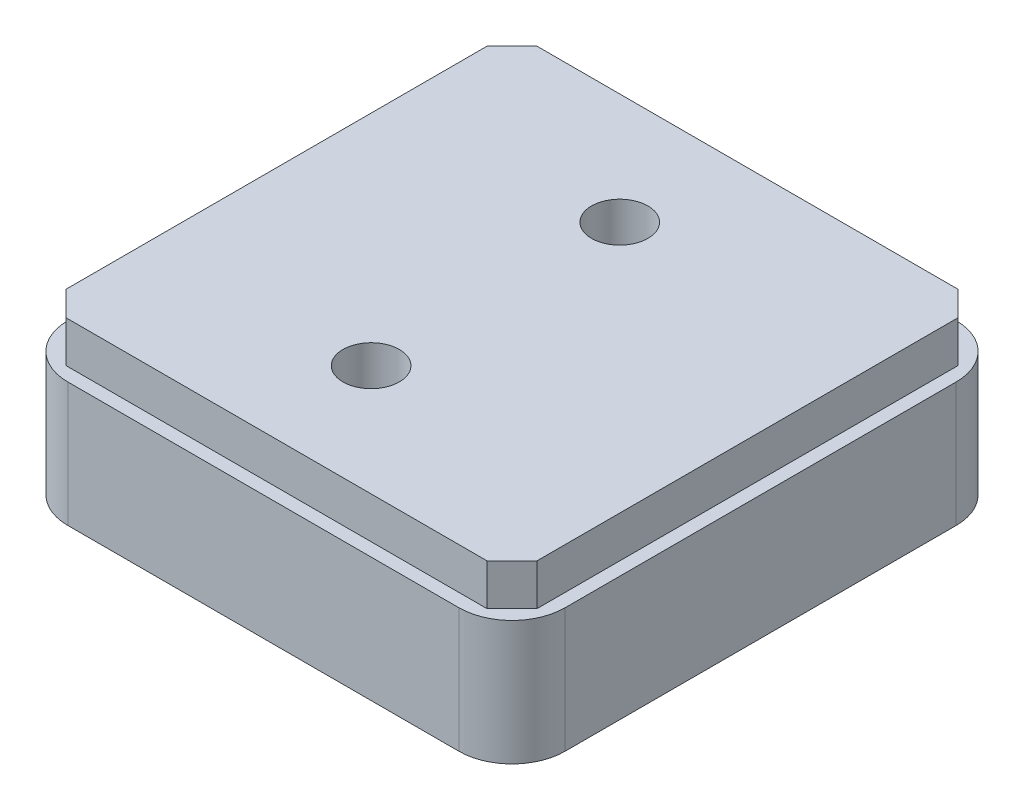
ISO-10303-21;
HEADER;
FILE_DESCRIPTION(('STEP AP214'),'2;1');
FILE_NAME('part.step','',(''),(''),'','','');
FILE_SCHEMA(('AUTOMOTIVE_DESIGN { 1 0 10303 214 1 1 1 1 }'));
ENDSEC;
DATA;
#1=APPLICATION_CONTEXT('core data for automotive mechanical design processes');
#2=APPLICATION_PROTOCOL_DEFINITION('international standard','automotive_design',2000,#1);
#3=PRODUCT_CONTEXT('',#1,'mechanical');
#4=PRODUCT('Part','Part','',(#3));
#5=PRODUCT_RELATED_PRODUCT_CATEGORY('part','',(#4));
#6=PRODUCT_DEFINITION_FORMATION('','',#4);
#7=PRODUCT_DEFINITION_CONTEXT('part definition',#1,'design');
#8=PRODUCT_DEFINITION('design','',#6,#7);
#9=PRODUCT_DEFINITION_SHAPE('','',#8);
#10=(LENGTH_UNIT() NAMED_UNIT(*) SI_UNIT(.MILLI.,.METRE.));
#11=(NAMED_UNIT(*) PLANE_ANGLE_UNIT() SI_UNIT($,.RADIAN.));
#12=(NAMED_UNIT(*) SI_UNIT($,.STERADIAN.) SOLID_ANGLE_UNIT());
#13=UNCERTAINTY_MEASURE_WITH_UNIT(LENGTH_MEASURE(1.E-05),#10,'distance_accuracy_value','');
#14=(GEOMETRIC_REPRESENTATION_CONTEXT(3) GLOBAL_UNCERTAINTY_ASSIGNED_CONTEXT((#13)) GLOBAL_UNIT_ASSIGNED_CONTEXT((#10,
#11,#12)) REPRESENTATION_CONTEXT('',''));
#15=CARTESIAN_POINT('',(0.,0.,0.));
#16=DIRECTION('',(0.,0.,1.));
#17=DIRECTION('',(1.,0.,0.));
#18=AXIS2_PLACEMENT_3D('',#15,#16,#17);
#19=CARTESIAN_POINT('',(-28.4,15.,25.4));
#20=DIRECTION('',(-0.707106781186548,0.,0.707106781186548));
#21=DIRECTION('',(0.707106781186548,0.,0.707106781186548));
#22=AXIS2_PLACEMENT_3D('',#19,#20,#21);
#23=PLANE('',#22);
#24=DIRECTION('',(0.707106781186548,0.,0.707106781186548));
#25=VECTOR('',#24,1.);
#26=CARTESIAN_POINT('',(-28.4,20.,25.4));
#27=LINE('',#26,#25);
#28=CARTESIAN_POINT('',(-28.4,20.,25.4));
#29=VERTEX_POINT('',#28);
#30=CARTESIAN_POINT('',(-25.4,20.,28.4));
#31=VERTEX_POINT('',#30);
#32=EDGE_CURVE('E181',#29,#31,#27,.T.);
#33=ORIENTED_EDGE('',*,*,#32,.F.);
#34=DIRECTION('',(0.,1.,0.));
#35=VECTOR('',#34,1.);
#36=CARTESIAN_POINT('',(-28.4,15.,25.4));
#37=LINE('',#36,#35);
#38=CARTESIAN_POINT('',(-28.4,15.,25.4));
#39=VERTEX_POINT('',#38);
#40=EDGE_CURVE('E13',#39,#29,#37,.T.);
#41=ORIENTED_EDGE('',*,*,#40,.F.);
#42=DIRECTION('',(0.707106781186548,0.,0.707106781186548));
#43=VECTOR('',#42,1.);
#44=CARTESIAN_POINT('',(-28.4,15.,25.4));
#45=LINE('',#44,#43);
#46=CARTESIAN_POINT('',(-25.4,15.,28.4));
#47=VERTEX_POINT('',#46);
#48=EDGE_CURVE('E202',#39,#47,#45,.T.);
#49=ORIENTED_EDGE('',*,*,#48,.T.);
#50=DIRECTION('',(0.,1.,0.));
#51=VECTOR('',#50,1.);
#52=CARTESIAN_POINT('',(-25.4,15.,28.4));
#53=LINE('',#52,#51);
#54=EDGE_CURVE('E87',#47,#31,#53,.T.);
#55=ORIENTED_EDGE('',*,*,#54,.T.);
#56=EDGE_LOOP('',(#33,#41,#49,#55));
#57=FACE_BOUND('',#56,.T.);
#58=ADVANCED_FACE('F84',(#57),#23,.T.);
#59=CARTESIAN_POINT('',(-28.4,15.,-25.4));
#60=DIRECTION('',(-1.,0.,0.));
#61=DIRECTION('',(0.,0.,1.));
#62=AXIS2_PLACEMENT_3D('',#59,#60,#61);
#63=PLANE('',#62);
#64=DIRECTION('',(0.,0.,1.));
#65=VECTOR('',#64,1.);
#66=CARTESIAN_POINT('',(-28.4,20.,-25.4));
#67=LINE('',#66,#65);
#68=CARTESIAN_POINT('',(-28.4,20.,-25.4));
#69=VERTEX_POINT('',#68);
#70=EDGE_CURVE('E200',#69,#29,#67,.T.);
#71=ORIENTED_EDGE('',*,*,#70,.F.);
#72=DIRECTION('',(0.,1.,0.));
#73=VECTOR('',#72,1.);
#74=CARTESIAN_POINT('',(-28.4,15.,-25.4));
#75=LINE('',#74,#73);
#76=CARTESIAN_POINT('',(-28.4,15.,-25.4));
#77=VERTEX_POINT('',#76);
#78=EDGE_CURVE('E93',#77,#69,#75,.T.);
#79=ORIENTED_EDGE('',*,*,#78,.F.);
#80=DIRECTION('',(0.,0.,1.));
#81=VECTOR('',#80,1.);
#82=CARTESIAN_POINT('',(-28.4,15.,-25.4));
#83=LINE('',#82,#81);
#84=EDGE_CURVE('E171',#77,#39,#83,.T.);
#85=ORIENTED_EDGE('',*,*,#84,.T.);
#86=ORIENTED_EDGE('',*,*,#40,.T.);
#87=EDGE_LOOP('',(#71,#79,#85,#86));
#88=FACE_BOUND('',#87,.T.);
#89=ADVANCED_FACE('F214',(#88),#63,.T.);
#90=CARTESIAN_POINT('',(-25.4,15.,-28.4));
#91=DIRECTION('',(-0.707106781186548,0.,-0.707106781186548));
#92=DIRECTION('',(-0.707106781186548,0.,0.707106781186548));
#93=AXIS2_PLACEMENT_3D('',#90,#91,#92);
#94=PLANE('',#93);
#95=DIRECTION('',(-0.707106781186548,0.,0.707106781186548));
#96=VECTOR('',#95,1.);
#97=CARTESIAN_POINT('',(-25.4,20.,-28.4));
#98=LINE('',#97,#96);
#99=CARTESIAN_POINT('',(-25.4,20.,-28.4));
#100=VERTEX_POINT('',#99);
#101=EDGE_CURVE('E158',#100,#69,#98,.T.);
#102=ORIENTED_EDGE('',*,*,#101,.F.);
#103=DIRECTION('',(0.,1.,0.));
#104=VECTOR('',#103,1.);
#105=CARTESIAN_POINT('',(-25.4,15.,-28.4));
#106=LINE('',#105,#104);
#107=CARTESIAN_POINT('',(-25.4,15.,-28.4));
#108=VERTEX_POINT('',#107);
#109=EDGE_CURVE('E153',#108,#100,#106,.T.);
#110=ORIENTED_EDGE('',*,*,#109,.F.);
#111=DIRECTION('',(-0.707106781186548,0.,0.707106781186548));
#112=VECTOR('',#111,1.);
#113=CARTESIAN_POINT('',(-25.4,15.,-28.4));
#114=LINE('',#113,#112);
#115=EDGE_CURVE('E156',#108,#77,#114,.T.);
#116=ORIENTED_EDGE('',*,*,#115,.T.);
#117=ORIENTED_EDGE('',*,*,#78,.T.);
#118=EDGE_LOOP('',(#102,#110,#116,#117));
#119=FACE_BOUND('',#118,.T.);
#120=ADVANCED_FACE('F155',(#119),#94,.T.);
#121=CARTESIAN_POINT('',(25.4,15.,-28.4));
#122=DIRECTION('',(0.,0.,-1.));
#123=DIRECTION('',(-1.,0.,0.));
#124=AXIS2_PLACEMENT_3D('',#121,#122,#123);
#125=PLANE('',#124);
#126=DIRECTION('',(-1.,0.,0.));
#127=VECTOR('',#126,1.);
#128=CARTESIAN_POINT('',(25.4,20.,-28.4));
#129=LINE('',#128,#127);
#130=CARTESIAN_POINT('',(25.4,20.,-28.4));
#131=VERTEX_POINT('',#130);
#132=EDGE_CURVE('E197',#131,#100,#129,.T.);
#133=ORIENTED_EDGE('',*,*,#132,.F.);
#134=DIRECTION('',(0.,1.,0.));
#135=VECTOR('',#134,1.);
#136=CARTESIAN_POINT('',(25.4,15.,-28.4));
#137=LINE('',#136,#135);
#138=CARTESIAN_POINT('',(25.4,15.,-28.4));
#139=VERTEX_POINT('',#138);
#140=EDGE_CURVE('E163',#139,#131,#137,.T.);
#141=ORIENTED_EDGE('',*,*,#140,.F.);
#142=DIRECTION('',(-1.,0.,0.));
#143=VECTOR('',#142,1.);
#144=CARTESIAN_POINT('',(25.4,15.,-28.4));
#145=LINE('',#144,#143);
#146=EDGE_CURVE('E169',#139,#108,#145,.T.);
#147=ORIENTED_EDGE('',*,*,#146,.T.);
#148=ORIENTED_EDGE('',*,*,#109,.T.);
#149=EDGE_LOOP('',(#133,#141,#147,#148));
#150=FACE_BOUND('',#149,.T.);
#151=ADVANCED_FACE('F173',(#150),#125,.T.);
#152=CARTESIAN_POINT('',(28.4,15.,-25.4));
#153=DIRECTION('',(0.707106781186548,0.,-0.707106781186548));
#154=DIRECTION('',(-0.707106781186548,0.,-0.707106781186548));
#155=AXIS2_PLACEMENT_3D('',#152,#153,#154);
#156=PLANE('',#155);
#157=DIRECTION('',(-0.707106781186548,0.,-0.707106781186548));
#158=VECTOR('',#157,1.);
#159=CARTESIAN_POINT('',(28.4,20.,-25.4));
#160=LINE('',#159,#158);
#161=CARTESIAN_POINT('',(28.4,20.,-25.4));
#162=VERTEX_POINT('',#161);
#163=EDGE_CURVE('E194',#162,#131,#160,.T.);
#164=ORIENTED_EDGE('',*,*,#163,.F.);
#165=DIRECTION('',(0.,1.,0.));
#166=VECTOR('',#165,1.);
#167=CARTESIAN_POINT('',(28.4,15.,-25.4));
#168=LINE('',#167,#166);
#169=CARTESIAN_POINT('',(28.4,15.,-25.4));
#170=VERTEX_POINT('',#169);
#171=EDGE_CURVE('E206',#170,#162,#168,.T.);
#172=ORIENTED_EDGE('',*,*,#171,.F.);
#173=DIRECTION('',(-0.707106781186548,0.,-0.707106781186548));
#174=VECTOR('',#173,1.);
#175=CARTESIAN_POINT('',(28.4,15.,-25.4));
#176=LINE('',#175,#174);
#177=EDGE_CURVE('E174',#170,#139,#176,.T.);
#178=ORIENTED_EDGE('',*,*,#177,.T.);
#179=ORIENTED_EDGE('',*,*,#140,.T.);
#180=EDGE_LOOP('',(#164,#172,#178,#179));
#181=FACE_BOUND('',#180,.T.);
#182=ADVANCED_FACE('F227',(#181),#156,.T.);
#183=CARTESIAN_POINT('',(28.4,15.,25.4));
#184=DIRECTION('',(1.,0.,0.));
#185=DIRECTION('',(0.,0.,-1.));
#186=AXIS2_PLACEMENT_3D('',#183,#184,#185);
#187=PLANE('',#186);
#188=DIRECTION('',(0.,0.,-1.));
#189=VECTOR('',#188,1.);
#190=CARTESIAN_POINT('',(28.4,20.,25.4));
#191=LINE('',#190,#189);
#192=CARTESIAN_POINT('',(28.4,20.,25.4));
#193=VERTEX_POINT('',#192);
#194=EDGE_CURVE('E191',#193,#162,#191,.T.);
#195=ORIENTED_EDGE('',*,*,#194,.F.);
#196=DIRECTION('',(0.,1.,0.));
#197=VECTOR('',#196,1.);
#198=CARTESIAN_POINT('',(28.4,15.,25.4));
#199=LINE('',#198,#197);
#200=CARTESIAN_POINT('',(28.4,15.,25.4));
#201=VERTEX_POINT('',#200);
#202=EDGE_CURVE('E208',#201,#193,#199,.T.);
#203=ORIENTED_EDGE('',*,*,#202,.F.);
#204=DIRECTION('',(0.,0.,-1.));
#205=VECTOR('',#204,1.);
#206=CARTESIAN_POINT('',(28.4,15.,25.4));
#207=LINE('',#206,#205);
#208=EDGE_CURVE('E176',#201,#170,#207,.T.);
#209=ORIENTED_EDGE('',*,*,#208,.T.);
#210=ORIENTED_EDGE('',*,*,#171,.T.);
#211=EDGE_LOOP('',(#195,#203,#209,#210));
#212=FACE_BOUND('',#211,.T.);
#213=ADVANCED_FACE('F230',(#212),#187,.T.);
#214=CARTESIAN_POINT('',(25.4,15.,28.4));
#215=DIRECTION('',(0.707106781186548,0.,0.707106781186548));
#216=DIRECTION('',(0.707106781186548,0.,-0.707106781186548));
#217=AXIS2_PLACEMENT_3D('',#214,#215,#216);
#218=PLANE('',#217);
#219=DIRECTION('',(0.707106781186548,0.,-0.707106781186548));
#220=VECTOR('',#219,1.);
#221=CARTESIAN_POINT('',(25.4,20.,28.4));
#222=LINE('',#221,#220);
#223=CARTESIAN_POINT('',(25.4,20.,28.4));
#224=VERTEX_POINT('',#223);
#225=EDGE_CURVE('E188',#224,#193,#222,.T.);
#226=ORIENTED_EDGE('',*,*,#225,.F.);
#227=DIRECTION('',(0.,1.,0.));
#228=VECTOR('',#227,1.);
#229=CARTESIAN_POINT('',(25.4,15.,28.4));
#230=LINE('',#229,#228);
#231=CARTESIAN_POINT('',(25.4,15.,28.4));
#232=VERTEX_POINT('',#231);
#233=EDGE_CURVE('E209',#232,#224,#230,.T.);
#234=ORIENTED_EDGE('',*,*,#233,.F.);
#235=DIRECTION('',(0.707106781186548,0.,-0.707106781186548));
#236=VECTOR('',#235,1.);
#237=CARTESIAN_POINT('',(25.4,15.,28.4));
#238=LINE('',#237,#236);
#239=EDGE_CURVE('E276',#232,#201,#238,.T.);
#240=ORIENTED_EDGE('',*,*,#239,.T.);
#241=ORIENTED_EDGE('',*,*,#202,.T.);
#242=EDGE_LOOP('',(#226,#234,#240,#241));
#243=FACE_BOUND('',#242,.T.);
#244=ADVANCED_FACE('F234',(#243),#218,.T.);
#245=CARTESIAN_POINT('',(-25.4,15.,28.4));
#246=DIRECTION('',(0.,0.,1.));
#247=DIRECTION('',(1.,0.,0.));
#248=AXIS2_PLACEMENT_3D('',#245,#246,#247);
#249=PLANE('',#248);
#250=DIRECTION('',(1.,0.,0.));
#251=VECTOR('',#250,1.);
#252=CARTESIAN_POINT('',(-25.4,20.,28.4));
#253=LINE('',#252,#251);
#254=EDGE_CURVE('E184',#31,#224,#253,.T.);
#255=ORIENTED_EDGE('',*,*,#254,.F.);
#256=ORIENTED_EDGE('',*,*,#54,.F.);
#257=DIRECTION('',(1.,0.,0.));
#258=VECTOR('',#257,1.);
#259=CARTESIAN_POINT('',(-25.4,15.,28.4));
#260=LINE('',#259,#258);
#261=EDGE_CURVE('E274',#47,#232,#260,.T.);
#262=ORIENTED_EDGE('',*,*,#261,.T.);
#263=ORIENTED_EDGE('',*,*,#233,.T.);
#264=EDGE_LOOP('',(#255,#256,#262,#263));
#265=FACE_BOUND('',#264,.T.);
#266=ADVANCED_FACE('F211',(#265),#249,.T.);
#267=CARTESIAN_POINT('',(0.,15.,53.8));
#268=DIRECTION('',(0.,1.,0.));
#269=DIRECTION('',(0.,0.,1.));
#270=AXIS2_PLACEMENT_3D('',#267,#268,#269);
#271=PLANE('',#270);
#272=CARTESIAN_POINT('',(-2.,15.,-15.));
#273=DIRECTION('',(0.,1.,0.));
#274=DIRECTION('',(0.,0.,1.));
#275=AXIS2_PLACEMENT_3D('',#272,#273,#274);
#276=CIRCLE('',#275,3.39999999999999);
#277=CARTESIAN_POINT('',(-2.,15.,-11.6));
#278=VERTEX_POINT('',#277);
#279=EDGE_CURVE('E261',#278,#278,#276,.T.);
#280=ORIENTED_EDGE('',*,*,#279,.T.);
#281=EDGE_LOOP('',(#280));
#282=FACE_BOUND('',#281,.T.);
#283=CARTESIAN_POINT('',(-2.,15.,15.));
#284=DIRECTION('',(0.,1.,0.));
#285=DIRECTION('',(0.,0.,1.));
#286=AXIS2_PLACEMENT_3D('',#283,#284,#285);
#287=CIRCLE('',#286,3.39999999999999);
#288=CARTESIAN_POINT('',(-2.,15.,18.4));
#289=VERTEX_POINT('',#288);
#290=EDGE_CURVE('E185',#289,#289,#287,.T.);
#291=ORIENTED_EDGE('',*,*,#290,.T.);
#292=EDGE_LOOP('',(#291));
#293=FACE_BOUND('',#292,.T.);
#294=ORIENTED_EDGE('',*,*,#48,.F.);
#295=ORIENTED_EDGE('',*,*,#84,.F.);
#296=ORIENTED_EDGE('',*,*,#115,.F.);
#297=ORIENTED_EDGE('',*,*,#146,.F.);
#298=ORIENTED_EDGE('',*,*,#177,.F.);
#299=ORIENTED_EDGE('',*,*,#208,.F.);
#300=ORIENTED_EDGE('',*,*,#239,.F.);
#301=ORIENTED_EDGE('',*,*,#261,.F.);
#302=EDGE_LOOP('',(#294,#295,#296,#297,#298,#299,#300,#301));
#303=FACE_BOUND('',#302,.T.);
#304=ADVANCED_FACE('F167',(#282,#293,#303),#271,.F.);
#305=CARTESIAN_POINT('',(0.,20.,53.8));
#306=DIRECTION('',(0.,1.,0.));
#307=DIRECTION('',(0.,0.,1.));
#308=AXIS2_PLACEMENT_3D('',#305,#306,#307);
#309=PLANE('',#308);
#310=CARTESIAN_POINT('',(-2.,20.,-15.));
#311=DIRECTION('',(0.,1.,0.));
#312=DIRECTION('',(0.,0.,1.));
#313=AXIS2_PLACEMENT_3D('',#310,#311,#312);
#314=CIRCLE('',#313,3.39999999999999);
#315=CARTESIAN_POINT('',(-2.,20.,-11.6));
#316=VERTEX_POINT('',#315);
#317=EDGE_CURVE('E264',#316,#316,#314,.T.);
#318=ORIENTED_EDGE('',*,*,#317,.F.);
#319=EDGE_LOOP('',(#318));
#320=FACE_BOUND('',#319,.T.);
#321=CARTESIAN_POINT('',(-2.,20.,15.));
#322=DIRECTION('',(0.,1.,0.));
#323=DIRECTION('',(0.,0.,1.));
#324=AXIS2_PLACEMENT_3D('',#321,#322,#323);
#325=CIRCLE('',#324,3.39999999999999);
#326=CARTESIAN_POINT('',(-2.,20.,18.4));
#327=VERTEX_POINT('',#326);
#328=EDGE_CURVE('E266',#327,#327,#325,.T.);
#329=ORIENTED_EDGE('',*,*,#328,.F.);
#330=EDGE_LOOP('',(#329));
#331=FACE_BOUND('',#330,.T.);
#332=ORIENTED_EDGE('',*,*,#32,.T.);
#333=ORIENTED_EDGE('',*,*,#254,.T.);
#334=ORIENTED_EDGE('',*,*,#225,.T.);
#335=ORIENTED_EDGE('',*,*,#194,.T.);
#336=ORIENTED_EDGE('',*,*,#163,.T.);
#337=ORIENTED_EDGE('',*,*,#132,.T.);
#338=ORIENTED_EDGE('',*,*,#101,.T.);
#339=ORIENTED_EDGE('',*,*,#70,.T.);
#340=EDGE_LOOP('',(#332,#333,#334,#335,#336,#337,#338,#339));
#341=FACE_BOUND('',#340,.T.);
#342=ADVANCED_FACE('F213',(#320,#331,#341),#309,.T.);
#343=CARTESIAN_POINT('',(-2.,20.,15.));
#344=DIRECTION('',(0.,1.,0.));
#345=DIRECTION('',(0.,0.,1.));
#346=AXIS2_PLACEMENT_3D('',#343,#344,#345);
#347=CYLINDRICAL_SURFACE('',#346,3.39999999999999);
#348=ORIENTED_EDGE('',*,*,#290,.F.);
#349=EDGE_LOOP('',(#348));
#350=FACE_BOUND('',#349,.T.);
#351=ORIENTED_EDGE('',*,*,#328,.T.);
#352=EDGE_LOOP('',(#351));
#353=FACE_BOUND('',#352,.T.);
#354=ADVANCED_FACE('F246',(#350,#353),#347,.F.);
#355=CARTESIAN_POINT('',(-2.,20.,-15.));
#356=DIRECTION('',(0.,1.,0.));
#357=DIRECTION('',(0.,0.,1.));
#358=AXIS2_PLACEMENT_3D('',#355,#356,#357);
#359=CYLINDRICAL_SURFACE('',#358,3.39999999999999);
#360=ORIENTED_EDGE('',*,*,#279,.F.);
#361=EDGE_LOOP('',(#360));
#362=FACE_BOUND('',#361,.T.);
#363=ORIENTED_EDGE('',*,*,#317,.T.);
#364=EDGE_LOOP('',(#363));
#365=FACE_BOUND('',#364,.T.);
#366=ADVANCED_FACE('F253',(#362,#365),#359,.F.);
#367=CLOSED_SHELL('',(#58,#89,#120,#151,#182,#213,#244,#266,#304,#342,#354,#366));
#368=MANIFOLD_SOLID_BREP('B2',#367);
#369=CARTESIAN_POINT('',(-23.6,20.,23.6));
#370=DIRECTION('',(0.,-1.,0.));
#371=DIRECTION('',(0.,0.,-1.));
#372=AXIS2_PLACEMENT_3D('',#369,#370,#371);
#373=CYLINDRICAL_SURFACE('',#372,6.4);
#374=CARTESIAN_POINT('',(-23.6,0.,23.6));
#375=DIRECTION('',(0.,1.,0.));
#376=DIRECTION('',(0.,0.,1.));
#377=AXIS2_PLACEMENT_3D('',#374,#375,#376);
#378=CIRCLE('',#377,6.4);
#379=CARTESIAN_POINT('',(-30.,0.,23.6));
#380=VERTEX_POINT('',#379);
#381=CARTESIAN_POINT('',(-23.6,0.,30.));
#382=VERTEX_POINT('',#381);
#383=EDGE_CURVE('E526',#380,#382,#378,.T.);
#384=ORIENTED_EDGE('',*,*,#383,.T.);
#385=DIRECTION('',(0.,-1.,0.));
#386=VECTOR('',#385,1.);
#387=CARTESIAN_POINT('',(-23.6,20.,30.));
#388=LINE('',#387,#386);
#389=CARTESIAN_POINT('',(-23.6,15.,30.));
#390=VERTEX_POINT('',#389);
#391=EDGE_CURVE('E82',#390,#382,#388,.T.);
#392=ORIENTED_EDGE('',*,*,#391,.F.);
#393=CARTESIAN_POINT('',(-23.6,15.,23.6));
#394=DIRECTION('',(0.,1.,0.));
#395=DIRECTION('',(0.,0.,1.));
#396=AXIS2_PLACEMENT_3D('',#393,#394,#395);
#397=CIRCLE('',#396,6.4);
#398=CARTESIAN_POINT('',(-30.,15.,23.6));
#399=VERTEX_POINT('',#398);
#400=EDGE_CURVE('E573',#399,#390,#397,.T.);
#401=ORIENTED_EDGE('',*,*,#400,.F.);
#402=DIRECTION('',(0.,-1.,0.));
#403=VECTOR('',#402,1.);
#404=CARTESIAN_POINT('',(-30.,20.,23.6));
#405=LINE('',#404,#403);
#406=EDGE_CURVE('E497',#399,#380,#405,.T.);
#407=ORIENTED_EDGE('',*,*,#406,.T.);
#408=EDGE_LOOP('',(#384,#392,#401,#407));
#409=FACE_BOUND('',#408,.T.);
#410=ADVANCED_FACE('F357',(#409),#373,.T.);
#411=CARTESIAN_POINT('',(-23.6,20.,30.));
#412=DIRECTION('',(0.,0.,-1.));
#413=DIRECTION('',(-1.,0.,0.));
#414=AXIS2_PLACEMENT_3D('',#411,#412,#413);
#415=PLANE('',#414);
#416=DIRECTION('',(1.,0.,0.));
#417=VECTOR('',#416,1.);
#418=CARTESIAN_POINT('',(-23.6,0.,30.));
#419=LINE('',#418,#417);
#420=CARTESIAN_POINT('',(23.6,0.,30.));
#421=VERTEX_POINT('',#420);
#422=EDGE_CURVE('E529',#382,#421,#419,.T.);
#423=ORIENTED_EDGE('',*,*,#422,.T.);
#424=DIRECTION('',(0.,-1.,0.));
#425=VECTOR('',#424,1.);
#426=CARTESIAN_POINT('',(23.6,20.,30.));
#427=LINE('',#426,#425);
#428=CARTESIAN_POINT('',(23.6,15.,30.));
#429=VERTEX_POINT('',#428);
#430=EDGE_CURVE('E367',#429,#421,#427,.T.);
#431=ORIENTED_EDGE('',*,*,#430,.F.);
#432=DIRECTION('',(1.,0.,0.));
#433=VECTOR('',#432,1.);
#434=CARTESIAN_POINT('',(-23.6,15.,30.));
#435=LINE('',#434,#433);
#436=EDGE_CURVE('E361',#390,#429,#435,.T.);
#437=ORIENTED_EDGE('',*,*,#436,.F.);
#438=ORIENTED_EDGE('',*,*,#391,.T.);
#439=EDGE_LOOP('',(#423,#431,#437,#438));
#440=FACE_BOUND('',#439,.T.);
#441=ADVANCED_FACE('F627',(#440),#415,.F.);
#442=CARTESIAN_POINT('',(23.6,20.,23.6));
#443=DIRECTION('',(0.,-1.,0.));
#444=DIRECTION('',(0.,0.,-1.));
#445=AXIS2_PLACEMENT_3D('',#442,#443,#444);
#446=CYLINDRICAL_SURFACE('',#445,6.4);
#447=CARTESIAN_POINT('',(23.6,0.,23.6));
#448=DIRECTION('',(0.,1.,0.));
#449=DIRECTION('',(0.,0.,1.));
#450=AXIS2_PLACEMENT_3D('',#447,#448,#449);
#451=CIRCLE('',#450,6.4);
#452=CARTESIAN_POINT('',(30.,0.,23.6));
#453=VERTEX_POINT('',#452);
#454=EDGE_CURVE('E531',#421,#453,#451,.T.);
#455=ORIENTED_EDGE('',*,*,#454,.T.);
#456=DIRECTION('',(0.,-1.,0.));
#457=VECTOR('',#456,1.);
#458=CARTESIAN_POINT('',(30.,20.,23.6));
#459=LINE('',#458,#457);
#460=CARTESIAN_POINT('',(30.,15.,23.6));
#461=VERTEX_POINT('',#460);
#462=EDGE_CURVE('E553',#461,#453,#459,.T.);
#463=ORIENTED_EDGE('',*,*,#462,.F.);
#464=CARTESIAN_POINT('',(23.6,15.,23.6));
#465=DIRECTION('',(0.,1.,0.));
#466=DIRECTION('',(0.,0.,1.));
#467=AXIS2_PLACEMENT_3D('',#464,#465,#466);
#468=CIRCLE('',#467,6.4);
#469=EDGE_CURVE('E599',#429,#461,#468,.T.);
#470=ORIENTED_EDGE('',*,*,#469,.F.);
#471=ORIENTED_EDGE('',*,*,#430,.T.);
#472=EDGE_LOOP('',(#455,#463,#470,#471));
#473=FACE_BOUND('',#472,.T.);
#474=ADVANCED_FACE('F605',(#473),#446,.T.);
#475=CARTESIAN_POINT('',(30.,20.,-23.6));
#476=DIRECTION('',(-1.,0.,0.));
#477=DIRECTION('',(0.,0.,1.));
#478=AXIS2_PLACEMENT_3D('',#475,#476,#477);
#479=PLANE('',#478);
#480=DIRECTION('',(0.,0.,-1.));
#481=VECTOR('',#480,1.);
#482=CARTESIAN_POINT('',(30.,0.,-23.6));
#483=LINE('',#482,#481);
#484=CARTESIAN_POINT('',(30.,0.,-23.6));
#485=VERTEX_POINT('',#484);
#486=EDGE_CURVE('E533',#453,#485,#483,.T.);
#487=ORIENTED_EDGE('',*,*,#486,.T.);
#488=DIRECTION('',(0.,-1.,0.));
#489=VECTOR('',#488,1.);
#490=CARTESIAN_POINT('',(30.,20.,-23.6));
#491=LINE('',#490,#489);
#492=CARTESIAN_POINT('',(30.,15.,-23.6));
#493=VERTEX_POINT('',#492);
#494=EDGE_CURVE('E550',#493,#485,#491,.T.);
#495=ORIENTED_EDGE('',*,*,#494,.F.);
#496=DIRECTION('',(0.,0.,-1.));
#497=VECTOR('',#496,1.);
#498=CARTESIAN_POINT('',(30.,15.,-23.6));
#499=LINE('',#498,#497);
#500=EDGE_CURVE('E598',#461,#493,#499,.T.);
#501=ORIENTED_EDGE('',*,*,#500,.F.);
#502=ORIENTED_EDGE('',*,*,#462,.T.);
#503=EDGE_LOOP('',(#487,#495,#501,#502));
#504=FACE_BOUND('',#503,.T.);
#505=ADVANCED_FACE('F609',(#504),#479,.F.);
#506=CARTESIAN_POINT('',(23.6,20.,-23.6));
#507=DIRECTION('',(0.,-1.,0.));
#508=DIRECTION('',(0.,0.,-1.));
#509=AXIS2_PLACEMENT_3D('',#506,#507,#508);
#510=CYLINDRICAL_SURFACE('',#509,6.4);
#511=CARTESIAN_POINT('',(23.6,0.,-23.6));
#512=DIRECTION('',(0.,1.,0.));
#513=DIRECTION('',(0.,0.,1.));
#514=AXIS2_PLACEMENT_3D('',#511,#512,#513);
#515=CIRCLE('',#514,6.4);
#516=CARTESIAN_POINT('',(23.6,0.,-30.));
#517=VERTEX_POINT('',#516);
#518=EDGE_CURVE('E535',#485,#517,#515,.T.);
#519=ORIENTED_EDGE('',*,*,#518,.T.);
#520=DIRECTION('',(0.,-1.,0.));
#521=VECTOR('',#520,1.);
#522=CARTESIAN_POINT('',(23.6,20.,-30.));
#523=LINE('',#522,#521);
#524=CARTESIAN_POINT('',(23.6,15.,-30.));
#525=VERTEX_POINT('',#524);
#526=EDGE_CURVE('E547',#525,#517,#523,.T.);
#527=ORIENTED_EDGE('',*,*,#526,.F.);
#528=CARTESIAN_POINT('',(23.6,15.,-23.6));
#529=DIRECTION('',(0.,1.,0.));
#530=DIRECTION('',(0.,0.,1.));
#531=AXIS2_PLACEMENT_3D('',#528,#529,#530);
#532=CIRCLE('',#531,6.4);
#533=EDGE_CURVE('E596',#493,#525,#532,.T.);
#534=ORIENTED_EDGE('',*,*,#533,.F.);
#535=ORIENTED_EDGE('',*,*,#494,.T.);
#536=EDGE_LOOP('',(#519,#527,#534,#535));
#537=FACE_BOUND('',#536,.T.);
#538=ADVANCED_FACE('F614',(#537),#510,.T.);
#539=CARTESIAN_POINT('',(23.6,20.,-30.));
#540=DIRECTION('',(0.,0.,1.));
#541=DIRECTION('',(1.,0.,0.));
#542=AXIS2_PLACEMENT_3D('',#539,#540,#541);
#543=PLANE('',#542);
#544=DIRECTION('',(-1.,0.,0.));
#545=VECTOR('',#544,1.);
#546=CARTESIAN_POINT('',(23.6,0.,-30.));
#547=LINE('',#546,#545);
#548=CARTESIAN_POINT('',(-23.6,0.,-30.));
#549=VERTEX_POINT('',#548);
#550=EDGE_CURVE('E537',#517,#549,#547,.T.);
#551=ORIENTED_EDGE('',*,*,#550,.T.);
#552=DIRECTION('',(0.,-1.,0.));
#553=VECTOR('',#552,1.);
#554=CARTESIAN_POINT('',(-23.6,20.,-30.));
#555=LINE('',#554,#553);
#556=CARTESIAN_POINT('',(-23.6,15.,-30.));
#557=VERTEX_POINT('',#556);
#558=EDGE_CURVE('E545',#557,#549,#555,.T.);
#559=ORIENTED_EDGE('',*,*,#558,.F.);
#560=DIRECTION('',(-1.,0.,0.));
#561=VECTOR('',#560,1.);
#562=CARTESIAN_POINT('',(23.6,15.,-30.));
#563=LINE('',#562,#561);
#564=EDGE_CURVE('E594',#525,#557,#563,.T.);
#565=ORIENTED_EDGE('',*,*,#564,.F.);
#566=ORIENTED_EDGE('',*,*,#526,.T.);
#567=EDGE_LOOP('',(#551,#559,#565,#566));
#568=FACE_BOUND('',#567,.T.);
#569=ADVANCED_FACE('F619',(#568),#543,.F.);
#570=CARTESIAN_POINT('',(-23.6,20.,-23.6));
#571=DIRECTION('',(0.,-1.,0.));
#572=DIRECTION('',(0.,0.,-1.));
#573=AXIS2_PLACEMENT_3D('',#570,#571,#572);
#574=CYLINDRICAL_SURFACE('',#573,6.4);
#575=CARTESIAN_POINT('',(-23.6,0.,-23.6));
#576=DIRECTION('',(0.,1.,0.));
#577=DIRECTION('',(0.,0.,1.));
#578=AXIS2_PLACEMENT_3D('',#575,#576,#577);
#579=CIRCLE('',#578,6.4);
#580=CARTESIAN_POINT('',(-30.,0.,-23.6));
#581=VERTEX_POINT('',#580);
#582=EDGE_CURVE('E453',#549,#581,#579,.T.);
#583=ORIENTED_EDGE('',*,*,#582,.T.);
#584=DIRECTION('',(0.,-1.,0.));
#585=VECTOR('',#584,1.);
#586=CARTESIAN_POINT('',(-30.,20.,-23.6));
#587=LINE('',#586,#585);
#588=CARTESIAN_POINT('',(-30.,15.,-23.6));
#589=VERTEX_POINT('',#588);
#590=EDGE_CURVE('E543',#589,#581,#587,.T.);
#591=ORIENTED_EDGE('',*,*,#590,.F.);
#592=CARTESIAN_POINT('',(-23.6,15.,-23.6));
#593=DIRECTION('',(0.,1.,0.));
#594=DIRECTION('',(0.,0.,1.));
#595=AXIS2_PLACEMENT_3D('',#592,#593,#594);
#596=CIRCLE('',#595,6.4);
#597=EDGE_CURVE('E592',#557,#589,#596,.T.);
#598=ORIENTED_EDGE('',*,*,#597,.F.);
#599=ORIENTED_EDGE('',*,*,#558,.T.);
#600=EDGE_LOOP('',(#583,#591,#598,#599));
#601=FACE_BOUND('',#600,.T.);
#602=ADVANCED_FACE('F621',(#601),#574,.T.);
#603=CARTESIAN_POINT('',(23.6,20.,23.6));
#604=DIRECTION('',(0.,-1.,0.));
#605=DIRECTION('',(0.,0.,-1.));
#606=AXIS2_PLACEMENT_3D('',#603,#604,#605);
#607=CYLINDRICAL_SURFACE('',#606,3.20000000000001);
#608=CARTESIAN_POINT('',(23.6,0.,23.6));
#609=DIRECTION('',(0.,1.,0.));
#610=DIRECTION('',(0.,0.,1.));
#611=AXIS2_PLACEMENT_3D('',#608,#609,#610);
#612=CIRCLE('',#611,3.20000000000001);
#613=CARTESIAN_POINT('',(23.6,0.,26.8));
#614=VERTEX_POINT('',#613);
#615=CARTESIAN_POINT('',(26.8,0.,23.6));
#616=VERTEX_POINT('',#615);
#617=EDGE_CURVE('E500',#614,#616,#612,.T.);
#618=ORIENTED_EDGE('',*,*,#617,.F.);
#619=DIRECTION('',(0.,-1.,0.));
#620=VECTOR('',#619,1.);
#621=CARTESIAN_POINT('',(23.6,20.,26.8));
#622=LINE('',#621,#620);
#623=CARTESIAN_POINT('',(23.6,15.,26.8));
#624=VERTEX_POINT('',#623);
#625=EDGE_CURVE('E438',#624,#614,#622,.T.);
#626=ORIENTED_EDGE('',*,*,#625,.F.);
#627=CARTESIAN_POINT('',(23.6,15.,23.6));
#628=DIRECTION('',(0.,1.,0.));
#629=DIRECTION('',(0.,0.,1.));
#630=AXIS2_PLACEMENT_3D('',#627,#628,#629);
#631=CIRCLE('',#630,3.20000000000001);
#632=CARTESIAN_POINT('',(26.8,15.,23.6));
#633=VERTEX_POINT('',#632);
#634=EDGE_CURVE('E541',#624,#633,#631,.T.);
#635=ORIENTED_EDGE('',*,*,#634,.T.);
#636=DIRECTION('',(0.,-1.,0.));
#637=VECTOR('',#636,1.);
#638=CARTESIAN_POINT('',(26.8,20.,23.6));
#639=LINE('',#638,#637);
#640=EDGE_CURVE('E407',#633,#616,#639,.T.);
#641=ORIENTED_EDGE('',*,*,#640,.T.);
#642=EDGE_LOOP('',(#618,#626,#635,#641));
#643=FACE_BOUND('',#642,.T.);
#644=ADVANCED_FACE('F501',(#643),#607,.F.);
#645=CARTESIAN_POINT('',(-23.6,20.,26.8));
#646=DIRECTION('',(0.,0.,-1.));
#647=DIRECTION('',(-1.,0.,0.));
#648=AXIS2_PLACEMENT_3D('',#645,#646,#647);
#649=PLANE('',#648);
#650=DIRECTION('',(1.,0.,0.));
#651=VECTOR('',#650,1.);
#652=CARTESIAN_POINT('',(-23.6,0.,26.8));
#653=LINE('',#652,#651);
#654=CARTESIAN_POINT('',(-23.6,0.,26.8));
#655=VERTEX_POINT('',#654);
#656=EDGE_CURVE('E494',#655,#614,#653,.T.);
#657=ORIENTED_EDGE('',*,*,#656,.F.);
#658=DIRECTION('',(0.,-1.,0.));
#659=VECTOR('',#658,1.);
#660=CARTESIAN_POINT('',(-23.6,20.,26.8));
#661=LINE('',#660,#659);
#662=CARTESIAN_POINT('',(-23.6,15.,26.8));
#663=VERTEX_POINT('',#662);
#664=EDGE_CURVE('E432',#663,#655,#661,.T.);
#665=ORIENTED_EDGE('',*,*,#664,.F.);
#666=DIRECTION('',(1.,0.,0.));
#667=VECTOR('',#666,1.);
#668=CARTESIAN_POINT('',(-23.6,15.,26.8));
#669=LINE('',#668,#667);
#670=EDGE_CURVE('E496',#663,#624,#669,.T.);
#671=ORIENTED_EDGE('',*,*,#670,.T.);
#672=ORIENTED_EDGE('',*,*,#625,.T.);
#673=EDGE_LOOP('',(#657,#665,#671,#672));
#674=FACE_BOUND('',#673,.T.);
#675=ADVANCED_FACE('F492',(#674),#649,.T.);
#676=CARTESIAN_POINT('',(-23.6,20.,23.6));
#677=DIRECTION('',(0.,-1.,0.));
#678=DIRECTION('',(0.,0.,-1.));
#679=AXIS2_PLACEMENT_3D('',#676,#677,#678);
#680=CYLINDRICAL_SURFACE('',#679,3.20000000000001);
#681=CARTESIAN_POINT('',(-23.6,0.,23.6));
#682=DIRECTION('',(0.,1.,0.));
#683=DIRECTION('',(0.,0.,1.));
#684=AXIS2_PLACEMENT_3D('',#681,#682,#683);
#685=CIRCLE('',#684,3.20000000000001);
#686=CARTESIAN_POINT('',(-26.8,0.,23.6));
#687=VERTEX_POINT('',#686);
#688=EDGE_CURVE('E509',#687,#655,#685,.T.);
#689=ORIENTED_EDGE('',*,*,#688,.F.);
#690=DIRECTION('',(0.,-1.,0.));
#691=VECTOR('',#690,1.);
#692=CARTESIAN_POINT('',(-26.8,20.,23.6));
#693=LINE('',#692,#691);
#694=CARTESIAN_POINT('',(-26.8,15.,23.6));
#695=VERTEX_POINT('',#694);
#696=EDGE_CURVE('E567',#695,#687,#693,.T.);
#697=ORIENTED_EDGE('',*,*,#696,.F.);
#698=CARTESIAN_POINT('',(-23.6,15.,23.6));
#699=DIRECTION('',(0.,1.,0.));
#700=DIRECTION('',(0.,0.,1.));
#701=AXIS2_PLACEMENT_3D('',#698,#699,#700);
#702=CIRCLE('',#701,3.20000000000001);
#703=EDGE_CURVE('E586',#695,#663,#702,.T.);
#704=ORIENTED_EDGE('',*,*,#703,.T.);
#705=ORIENTED_EDGE('',*,*,#664,.T.);
#706=EDGE_LOOP('',(#689,#697,#704,#705));
#707=FACE_BOUND('',#706,.T.);
#708=ADVANCED_FACE('F661',(#707),#680,.F.);
#709=CARTESIAN_POINT('',(-26.8,20.,23.6));
#710=DIRECTION('',(1.,0.,0.));
#711=DIRECTION('',(0.,0.,-1.));
#712=AXIS2_PLACEMENT_3D('',#709,#710,#711);
#713=PLANE('',#712);
#714=DIRECTION('',(0.,0.,1.));
#715=VECTOR('',#714,1.);
#716=CARTESIAN_POINT('',(-26.8,0.,23.6));
#717=LINE('',#716,#715);
#718=CARTESIAN_POINT('',(-26.8,0.,-23.6));
#719=VERTEX_POINT('',#718);
#720=EDGE_CURVE('E511',#719,#687,#717,.T.);
#721=ORIENTED_EDGE('',*,*,#720,.F.);
#722=DIRECTION('',(0.,-1.,0.));
#723=VECTOR('',#722,1.);
#724=CARTESIAN_POINT('',(-26.8,20.,-23.6));
#725=LINE('',#724,#723);
#726=CARTESIAN_POINT('',(-26.8,15.,-23.6));
#727=VERTEX_POINT('',#726);
#728=EDGE_CURVE('E565',#727,#719,#725,.T.);
#729=ORIENTED_EDGE('',*,*,#728,.F.);
#730=DIRECTION('',(0.,0.,1.));
#731=VECTOR('',#730,1.);
#732=CARTESIAN_POINT('',(-26.8,15.,23.6));
#733=LINE('',#732,#731);
#734=EDGE_CURVE('E583',#727,#695,#733,.T.);
#735=ORIENTED_EDGE('',*,*,#734,.T.);
#736=ORIENTED_EDGE('',*,*,#696,.T.);
#737=EDGE_LOOP('',(#721,#729,#735,#736));
#738=FACE_BOUND('',#737,.T.);
#739=ADVANCED_FACE('F657',(#738),#713,.T.);
#740=CARTESIAN_POINT('',(-23.6,20.,-23.6));
#741=DIRECTION('',(0.,-1.,0.));
#742=DIRECTION('',(0.,0.,-1.));
#743=AXIS2_PLACEMENT_3D('',#740,#741,#742);
#744=CYLINDRICAL_SURFACE('',#743,3.20000000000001);
#745=CARTESIAN_POINT('',(-23.6,0.,-23.6));
#746=DIRECTION('',(0.,1.,0.));
#747=DIRECTION('',(0.,0.,1.));
#748=AXIS2_PLACEMENT_3D('',#745,#746,#747);
#749=CIRCLE('',#748,3.20000000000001);
#750=CARTESIAN_POINT('',(-23.6,0.,-26.8));
#751=VERTEX_POINT('',#750);
#752=EDGE_CURVE('E515',#751,#719,#749,.T.);
#753=ORIENTED_EDGE('',*,*,#752,.F.);
#754=DIRECTION('',(0.,-1.,0.));
#755=VECTOR('',#754,1.);
#756=CARTESIAN_POINT('',(-23.6,20.,-26.8));
#757=LINE('',#756,#755);
#758=CARTESIAN_POINT('',(-23.6,15.,-26.8));
#759=VERTEX_POINT('',#758);
#760=EDGE_CURVE('E563',#759,#751,#757,.T.);
#761=ORIENTED_EDGE('',*,*,#760,.F.);
#762=CARTESIAN_POINT('',(-23.6,15.,-23.6));
#763=DIRECTION('',(0.,1.,0.));
#764=DIRECTION('',(0.,0.,1.));
#765=AXIS2_PLACEMENT_3D('',#762,#763,#764);
#766=CIRCLE('',#765,3.20000000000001);
#767=EDGE_CURVE('E580',#759,#727,#766,.T.);
#768=ORIENTED_EDGE('',*,*,#767,.T.);
#769=ORIENTED_EDGE('',*,*,#728,.T.);
#770=EDGE_LOOP('',(#753,#761,#768,#769));
#771=FACE_BOUND('',#770,.T.);
#772=ADVANCED_FACE('F653',(#771),#744,.F.);
#773=CARTESIAN_POINT('',(23.6,20.,-26.8));
#774=DIRECTION('',(0.,0.,1.));
#775=DIRECTION('',(1.,0.,0.));
#776=AXIS2_PLACEMENT_3D('',#773,#774,#775);
#777=PLANE('',#776);
#778=DIRECTION('',(-1.,0.,0.));
#779=VECTOR('',#778,1.);
#780=CARTESIAN_POINT('',(23.6,0.,-26.8));
#781=LINE('',#780,#779);
#782=CARTESIAN_POINT('',(23.6,0.,-26.8));
#783=VERTEX_POINT('',#782);
#784=EDGE_CURVE('E518',#783,#751,#781,.T.);
#785=ORIENTED_EDGE('',*,*,#784,.F.);
#786=DIRECTION('',(0.,-1.,0.));
#787=VECTOR('',#786,1.);
#788=CARTESIAN_POINT('',(23.6,20.,-26.8));
#789=LINE('',#788,#787);
#790=CARTESIAN_POINT('',(23.6,15.,-26.8));
#791=VERTEX_POINT('',#790);
#792=EDGE_CURVE('E561',#791,#783,#789,.T.);
#793=ORIENTED_EDGE('',*,*,#792,.F.);
#794=DIRECTION('',(-1.,0.,0.));
#795=VECTOR('',#794,1.);
#796=CARTESIAN_POINT('',(23.6,15.,-26.8));
#797=LINE('',#796,#795);
#798=EDGE_CURVE('E577',#791,#759,#797,.T.);
#799=ORIENTED_EDGE('',*,*,#798,.T.);
#800=ORIENTED_EDGE('',*,*,#760,.T.);
#801=EDGE_LOOP('',(#785,#793,#799,#800));
#802=FACE_BOUND('',#801,.T.);
#803=ADVANCED_FACE('F649',(#802),#777,.T.);
#804=CARTESIAN_POINT('',(23.6,20.,-23.6));
#805=DIRECTION('',(0.,-1.,0.));
#806=DIRECTION('',(0.,0.,-1.));
#807=AXIS2_PLACEMENT_3D('',#804,#805,#806);
#808=CYLINDRICAL_SURFACE('',#807,3.2);
#809=CARTESIAN_POINT('',(23.6,0.,-23.6));
#810=DIRECTION('',(0.,1.,0.));
#811=DIRECTION('',(0.,0.,1.));
#812=AXIS2_PLACEMENT_3D('',#809,#810,#811);
#813=CIRCLE('',#812,3.2);
#814=CARTESIAN_POINT('',(26.8,0.,-23.6));
#815=VERTEX_POINT('',#814);
#816=EDGE_CURVE('E521',#815,#783,#813,.T.);
#817=ORIENTED_EDGE('',*,*,#816,.F.);
#818=DIRECTION('',(0.,-1.,0.));
#819=VECTOR('',#818,1.);
#820=CARTESIAN_POINT('',(26.8,20.,-23.6));
#821=LINE('',#820,#819);
#822=CARTESIAN_POINT('',(26.8,15.,-23.6));
#823=VERTEX_POINT('',#822);
#824=EDGE_CURVE('E559',#823,#815,#821,.T.);
#825=ORIENTED_EDGE('',*,*,#824,.F.);
#826=CARTESIAN_POINT('',(23.6,15.,-23.6));
#827=DIRECTION('',(0.,1.,0.));
#828=DIRECTION('',(0.,0.,1.));
#829=AXIS2_PLACEMENT_3D('',#826,#827,#828);
#830=CIRCLE('',#829,3.2);
#831=EDGE_CURVE('E574',#823,#791,#830,.T.);
#832=ORIENTED_EDGE('',*,*,#831,.T.);
#833=ORIENTED_EDGE('',*,*,#792,.T.);
#834=EDGE_LOOP('',(#817,#825,#832,#833));
#835=FACE_BOUND('',#834,.T.);
#836=ADVANCED_FACE('F646',(#835),#808,.F.);
#837=CARTESIAN_POINT('',(26.8,20.,-23.6));
#838=DIRECTION('',(-1.,0.,0.));
#839=DIRECTION('',(0.,0.,1.));
#840=AXIS2_PLACEMENT_3D('',#837,#838,#839);
#841=PLANE('',#840);
#842=DIRECTION('',(0.,0.,-1.));
#843=VECTOR('',#842,1.);
#844=CARTESIAN_POINT('',(26.8,0.,-23.6));
#845=LINE('',#844,#843);
#846=EDGE_CURVE('E524',#616,#815,#845,.T.);
#847=ORIENTED_EDGE('',*,*,#846,.F.);
#848=ORIENTED_EDGE('',*,*,#640,.F.);
#849=DIRECTION('',(0.,0.,-1.));
#850=VECTOR('',#849,1.);
#851=CARTESIAN_POINT('',(26.8,15.,-23.6));
#852=LINE('',#851,#850);
#853=EDGE_CURVE('E571',#633,#823,#852,.T.);
#854=ORIENTED_EDGE('',*,*,#853,.T.);
#855=ORIENTED_EDGE('',*,*,#824,.T.);
#856=EDGE_LOOP('',(#847,#848,#854,#855));
#857=FACE_BOUND('',#856,.T.);
#858=ADVANCED_FACE('F643',(#857),#841,.T.);
#859=CARTESIAN_POINT('',(-30.,20.,23.6));
#860=DIRECTION('',(1.,0.,0.));
#861=DIRECTION('',(0.,0.,-1.));
#862=AXIS2_PLACEMENT_3D('',#859,#860,#861);
#863=PLANE('',#862);
#864=DIRECTION('',(0.,0.,1.));
#865=VECTOR('',#864,1.);
#866=CARTESIAN_POINT('',(-30.,0.,23.6));
#867=LINE('',#866,#865);
#868=EDGE_CURVE('E445',#581,#380,#867,.T.);
#869=ORIENTED_EDGE('',*,*,#868,.T.);
#870=ORIENTED_EDGE('',*,*,#406,.F.);
#871=DIRECTION('',(0.,0.,1.));
#872=VECTOR('',#871,1.);
#873=CARTESIAN_POINT('',(-30.,15.,23.6));
#874=LINE('',#873,#872);
#875=EDGE_CURVE('E376',#589,#399,#874,.T.);
#876=ORIENTED_EDGE('',*,*,#875,.F.);
#877=ORIENTED_EDGE('',*,*,#590,.T.);
#878=EDGE_LOOP('',(#869,#870,#876,#877));
#879=FACE_BOUND('',#878,.T.);
#880=ADVANCED_FACE('F622',(#879),#863,.F.);
#881=CARTESIAN_POINT('',(0.,15.,53.8));
#882=DIRECTION('',(0.,1.,0.));
#883=DIRECTION('',(0.,0.,1.));
#884=AXIS2_PLACEMENT_3D('',#881,#882,#883);
#885=PLANE('',#884);
#886=ORIENTED_EDGE('',*,*,#634,.F.);
#887=ORIENTED_EDGE('',*,*,#670,.F.);
#888=ORIENTED_EDGE('',*,*,#703,.F.);
#889=ORIENTED_EDGE('',*,*,#734,.F.);
#890=ORIENTED_EDGE('',*,*,#767,.F.);
#891=ORIENTED_EDGE('',*,*,#798,.F.);
#892=ORIENTED_EDGE('',*,*,#831,.F.);
#893=ORIENTED_EDGE('',*,*,#853,.F.);
#894=EDGE_LOOP('',(#886,#887,#888,#889,#890,#891,#892,#893));
#895=FACE_BOUND('',#894,.T.);
#896=ORIENTED_EDGE('',*,*,#400,.T.);
#897=ORIENTED_EDGE('',*,*,#436,.T.);
#898=ORIENTED_EDGE('',*,*,#469,.T.);
#899=ORIENTED_EDGE('',*,*,#500,.T.);
#900=ORIENTED_EDGE('',*,*,#533,.T.);
#901=ORIENTED_EDGE('',*,*,#564,.T.);
#902=ORIENTED_EDGE('',*,*,#597,.T.);
#903=ORIENTED_EDGE('',*,*,#875,.T.);
#904=EDGE_LOOP('',(#896,#897,#898,#899,#900,#901,#902,#903));
#905=FACE_BOUND('',#904,.T.);
#906=ADVANCED_FACE('F359',(#895,#905),#885,.T.);
#907=CARTESIAN_POINT('',(-23.6,0.,23.6));
#908=DIRECTION('',(0.,1.,0.));
#909=DIRECTION('',(0.,0.,1.));
#910=AXIS2_PLACEMENT_3D('',#907,#908,#909);
#911=PLANE('',#910);
#912=ORIENTED_EDGE('',*,*,#617,.T.);
#913=ORIENTED_EDGE('',*,*,#846,.T.);
#914=ORIENTED_EDGE('',*,*,#816,.T.);
#915=ORIENTED_EDGE('',*,*,#784,.T.);
#916=ORIENTED_EDGE('',*,*,#752,.T.);
#917=ORIENTED_EDGE('',*,*,#720,.T.);
#918=ORIENTED_EDGE('',*,*,#688,.T.);
#919=ORIENTED_EDGE('',*,*,#656,.T.);
#920=EDGE_LOOP('',(#912,#913,#914,#915,#916,#917,#918,#919));
#921=FACE_BOUND('',#920,.T.);
#922=ORIENTED_EDGE('',*,*,#383,.F.);
#923=ORIENTED_EDGE('',*,*,#868,.F.);
#924=ORIENTED_EDGE('',*,*,#582,.F.);
#925=ORIENTED_EDGE('',*,*,#550,.F.);
#926=ORIENTED_EDGE('',*,*,#518,.F.);
#927=ORIENTED_EDGE('',*,*,#486,.F.);
#928=ORIENTED_EDGE('',*,*,#454,.F.);
#929=ORIENTED_EDGE('',*,*,#422,.F.);
#930=EDGE_LOOP('',(#922,#923,#924,#925,#926,#927,#928,#929));
#931=FACE_BOUND('',#930,.T.);
#932=ADVANCED_FACE('F505',(#921,#931),#911,.F.);
#933=CLOSED_SHELL('',(#410,#441,#474,#505,#538,#569,#602,#644,#675,#708,#739,#772,#803,#836,
#858,#880,#906,#932));
#934=MANIFOLD_SOLID_BREP('B7',#933);
#935=ADVANCED_BREP_SHAPE_REPRESENTATION('',(#18,#368,#934),#14);
#936=SHAPE_DEFINITION_REPRESENTATION(#9,#935);
ENDSEC;
END-ISO-10303-21;
